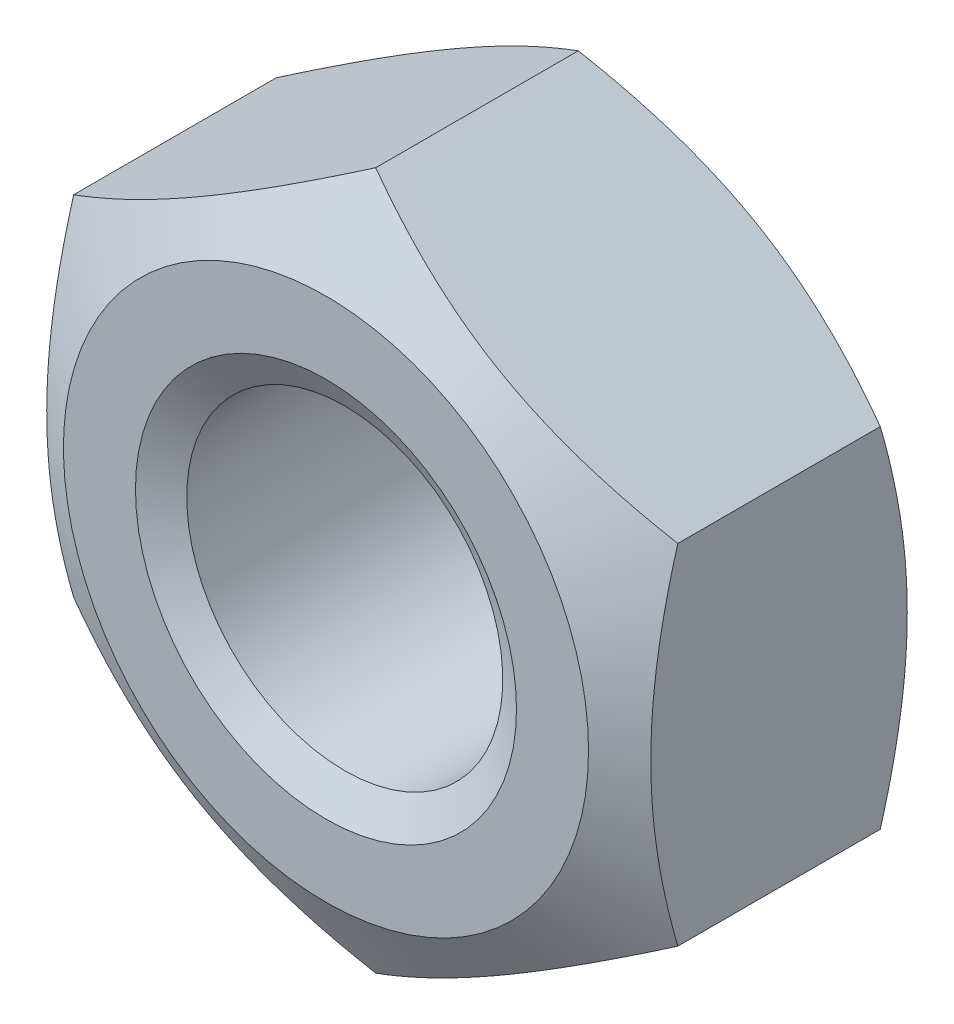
from build123d import *

# Parameters (mm, degrees)
BOSS_EXTRUDE1_DEPTH = 6.5


with BuildPart() as part:
    # Sketch1 → Boss-Extrude1 (new body)
    with BuildSketch(Plane.XY):
        Polygon((0, 7.505553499), (-6.5, 3.75277675), (-6.5, -3.75277675), (0, -7.505553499), (6.5, -3.75277675), (6.5, 3.75277675), align=None)
    extrude(amount=-BOSS_EXTRUDE1_DEPTH)

    # Sketch4 → Cut-Revolve1 (revolve, cut)
    with BuildSketch(Plane(origin=(0, 0, 0), x_dir=(0, 0, -1), z_dir=(1, 0, 0)), mode=Mode.PRIVATE) as cut_revolve1_sk:
        Polygon((6.5, 7.505553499), (5.428695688, 7.505553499), (6.5, 5.65), align=None)
        Polygon((0, 7.505553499), (1.071304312, 7.505553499), (0, 5.65), align=None)
    revolve(cut_revolve1_sk.sketch.rotate(Axis((0, 0, 0), (0, 0, -1)), 300.000000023), axis=Axis((0, 0, 0), (0, 0, -1)), mode=Mode.SUBTRACT)

    # Sketch5 → Cut-Revolve2 (revolve, cut)
    with BuildSketch(Plane(origin=(0, 0, 0), x_dir=(0, 0, -1), z_dir=(1, 0, 0)), mode=Mode.PRIVATE) as cut_revolve2_sk:
        Polygon((0, 0), (0, 4.1), (0.404145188, 3.4), (6.095854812, 3.4), (6.5, 4.1), (6.5, 0), align=None)
    revolve(cut_revolve2_sk.sketch.rotate(Axis((0, 0, 0), (0, 0, -1)), 180), axis=Axis((0, 0, 0), (0, 0, -1)), mode=Mode.SUBTRACT)


solid = part.part
